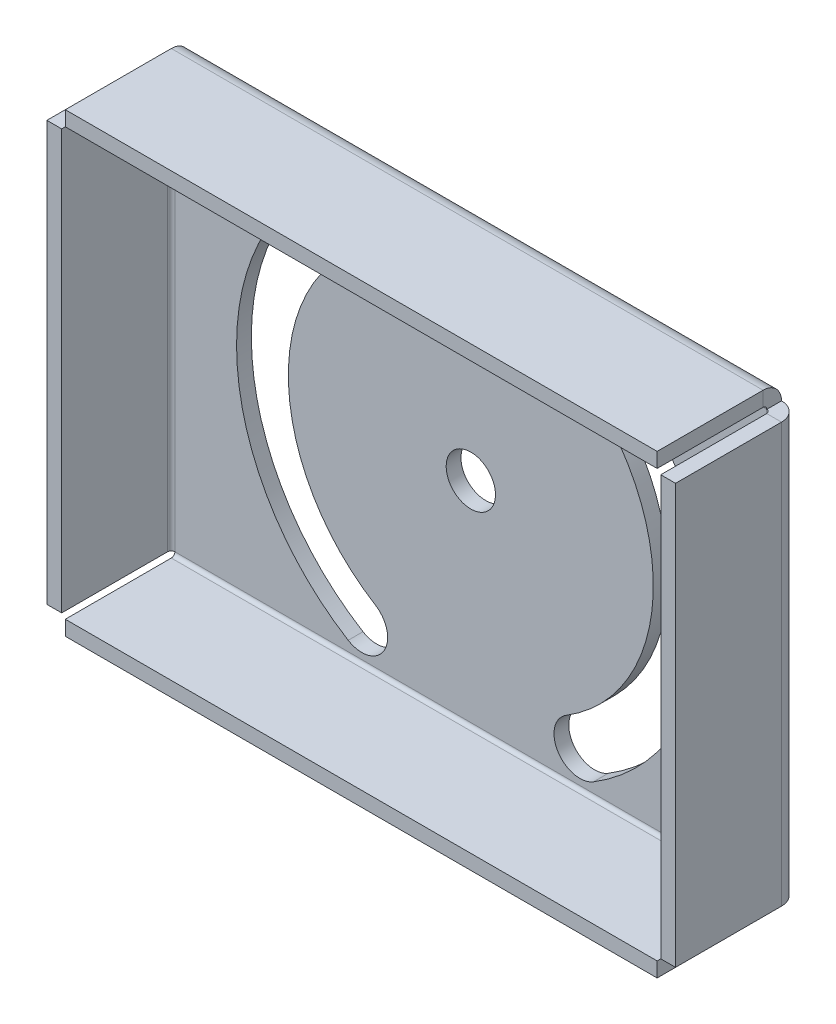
ISO-10303-21;
HEADER;
FILE_DESCRIPTION(('STEP AP214'),'2;1');
FILE_NAME('part.step','',(''),(''),'','','');
FILE_SCHEMA(('AUTOMOTIVE_DESIGN { 1 0 10303 214 1 1 1 1 }'));
ENDSEC;
DATA;
#1=APPLICATION_CONTEXT('core data for automotive mechanical design processes');
#2=APPLICATION_PROTOCOL_DEFINITION('international standard','automotive_design',2000,#1);
#3=PRODUCT_CONTEXT('',#1,'mechanical');
#4=PRODUCT('Part','Part','',(#3));
#5=PRODUCT_RELATED_PRODUCT_CATEGORY('part','',(#4));
#6=PRODUCT_DEFINITION_FORMATION('','',#4);
#7=PRODUCT_DEFINITION_CONTEXT('part definition',#1,'design');
#8=PRODUCT_DEFINITION('design','',#6,#7);
#9=PRODUCT_DEFINITION_SHAPE('','',#8);
#10=(LENGTH_UNIT() NAMED_UNIT(*) SI_UNIT(.MILLI.,.METRE.));
#11=(NAMED_UNIT(*) PLANE_ANGLE_UNIT() SI_UNIT($,.RADIAN.));
#12=(NAMED_UNIT(*) SI_UNIT($,.STERADIAN.) SOLID_ANGLE_UNIT());
#13=UNCERTAINTY_MEASURE_WITH_UNIT(LENGTH_MEASURE(1.E-05),#10,'distance_accuracy_value','');
#14=(GEOMETRIC_REPRESENTATION_CONTEXT(3) GLOBAL_UNCERTAINTY_ASSIGNED_CONTEXT((#13)) GLOBAL_UNIT_ASSIGNED_CONTEXT((#10,
#11,#12)) REPRESENTATION_CONTEXT('',''));
#15=CARTESIAN_POINT('',(0.,0.,0.));
#16=DIRECTION('',(0.,0.,1.));
#17=DIRECTION('',(1.,0.,0.));
#18=AXIS2_PLACEMENT_3D('',#15,#16,#17);
#19=CARTESIAN_POINT('',(-60.,67.5,0.));
#20=DIRECTION('',(0.,0.,-1.));
#21=DIRECTION('',(-1.00000000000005,0.,0.));
#22=AXIS2_PLACEMENT_3D('',#19,#20,#21);
#23=PLANE('',#22);
#24=CARTESIAN_POINT('',(0.,0.,0.));
#25=DIRECTION('',(0.,0.,1.));
#26=DIRECTION('',(-1.00000000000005,0.,0.));
#27=AXIS2_PLACEMENT_3D('',#24,#25,#26);
#28=CIRCLE('',#27,37.);
#29=CARTESIAN_POINT('',(-19.3667698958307,31.5266272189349,-8.2572837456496E-13));
#30=VERTEX_POINT('',#29);
#31=CARTESIAN_POINT('',(-19.3667698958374,-31.5266272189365,0.));
#32=VERTEX_POINT('',#31);
#33=EDGE_CURVE('E47',#30,#32,#28,.T.);
#34=ORIENTED_EDGE('',*,*,#33,.F.);
#35=CARTESIAN_POINT('',(-22.1147575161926,36.,0.));
#36=DIRECTION('',(0.,0.,-1.));
#37=DIRECTION('',(-1.00000000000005,0.,0.));
#38=AXIS2_PLACEMENT_3D('',#35,#36,#37);
#39=CIRCLE('',#38,5.24999999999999);
#40=CARTESIAN_POINT('',(-24.862745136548,40.4733727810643,0.));
#41=VERTEX_POINT('',#40);
#42=EDGE_CURVE('E235',#41,#30,#39,.T.);
#43=ORIENTED_EDGE('',*,*,#42,.F.);
#44=CARTESIAN_POINT('',(0.,0.,0.));
#45=DIRECTION('',(0.,0.,-1.));
#46=DIRECTION('',(-1.00000000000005,0.,0.));
#47=AXIS2_PLACEMENT_3D('',#44,#45,#46);
#48=CIRCLE('',#47,47.5);
#49=CARTESIAN_POINT('',(-24.862745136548,-40.4733727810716,-8.2572837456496E-13));
#50=VERTEX_POINT('',#49);
#51=EDGE_CURVE('E220',#50,#41,#48,.T.);
#52=ORIENTED_EDGE('',*,*,#51,.F.);
#53=CARTESIAN_POINT('',(-22.1147575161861,-36.0000000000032,0.));
#54=DIRECTION('',(0.,0.,-1.));
#55=DIRECTION('',(-1.00000000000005,0.,0.));
#56=AXIS2_PLACEMENT_3D('',#53,#54,#55);
#57=CIRCLE('',#56,5.24999999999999);
#58=EDGE_CURVE('E229',#32,#50,#57,.T.);
#59=ORIENTED_EDGE('',*,*,#58,.F.);
#60=EDGE_LOOP('',(#34,#43,#52,#59));
#61=FACE_BOUND('',#60,.T.);
#62=CARTESIAN_POINT('',(22.1147575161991,36.,-8.2572837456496E-13));
#63=DIRECTION('',(0.,0.,-1.));
#64=DIRECTION('',(-1.00000000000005,0.,0.));
#65=AXIS2_PLACEMENT_3D('',#62,#63,#64);
#66=CIRCLE('',#65,5.24999999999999);
#67=CARTESIAN_POINT('',(19.366769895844,31.5266272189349,0.));
#68=VERTEX_POINT('',#67);
#69=CARTESIAN_POINT('',(24.8627451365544,40.4733727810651,0.));
#70=VERTEX_POINT('',#69);
#71=EDGE_CURVE('E242',#68,#70,#66,.T.);
#72=ORIENTED_EDGE('',*,*,#71,.F.);
#73=CARTESIAN_POINT('',(0.,0.,0.));
#74=DIRECTION('',(0.,0.,1.));
#75=DIRECTION('',(-1.00000000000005,0.,0.));
#76=AXIS2_PLACEMENT_3D('',#73,#74,#75);
#77=CIRCLE('',#76,37.);
#78=CARTESIAN_POINT('',(19.3667698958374,-31.5266272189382,0.));
#79=VERTEX_POINT('',#78);
#80=EDGE_CURVE('E252',#79,#68,#77,.T.);
#81=ORIENTED_EDGE('',*,*,#80,.F.);
#82=CARTESIAN_POINT('',(22.1147575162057,-36.0000000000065,0.));
#83=DIRECTION('',(0.,0.,-1.));
#84=DIRECTION('',(-1.00000000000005,0.,0.));
#85=AXIS2_PLACEMENT_3D('',#82,#83,#84);
#86=CIRCLE('',#85,5.24999999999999);
#87=CARTESIAN_POINT('',(24.8627451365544,-40.4733727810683,0.));
#88=VERTEX_POINT('',#87);
#89=EDGE_CURVE('E249',#88,#79,#86,.T.);
#90=ORIENTED_EDGE('',*,*,#89,.F.);
#91=CARTESIAN_POINT('',(0.,0.,0.));
#92=DIRECTION('',(0.,0.,-1.));
#93=DIRECTION('',(-1.00000000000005,0.,0.));
#94=AXIS2_PLACEMENT_3D('',#91,#92,#93);
#95=CIRCLE('',#94,47.5);
#96=EDGE_CURVE('E246',#70,#88,#95,.T.);
#97=ORIENTED_EDGE('',*,*,#96,.F.);
#98=EDGE_LOOP('',(#72,#81,#90,#97));
#99=FACE_BOUND('',#98,.T.);
#100=CARTESIAN_POINT('',(0.,0.,0.));
#101=DIRECTION('',(0.,0.,-1.));
#102=DIRECTION('',(-1.00000000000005,0.,0.));
#103=AXIS2_PLACEMENT_3D('',#100,#101,#102);
#104=CIRCLE('',#103,4.99999999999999);
#105=CARTESIAN_POINT('',(-5.00000000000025,0.,0.));
#106=VERTEX_POINT('',#105);
#107=EDGE_CURVE('E258',#106,#106,#104,.T.);
#108=ORIENTED_EDGE('',*,*,#107,.F.);
#109=EDGE_LOOP('',(#108));
#110=FACE_BOUND('',#109,.T.);
#111=DIRECTION('',(0.,-1.00000000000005,0.));
#112=VECTOR('',#111,1.);
#113=CARTESIAN_POINT('',(60.0000000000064,67.5000000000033,-8.2572837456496E-13));
#114=LINE('',#113,#112);
#115=CARTESIAN_POINT('',(60.0000000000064,42.5,-4.462470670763E-08));
#116=VERTEX_POINT('',#115);
#117=CARTESIAN_POINT('',(60.0000000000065,-42.5000000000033,-6.29995847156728E-08));
#118=VERTEX_POINT('',#117);
#119=EDGE_CURVE('E441',#116,#118,#114,.T.);
#120=ORIENTED_EDGE('',*,*,#119,.T.);
#121=DIRECTION('',(-1.00000000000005,0.,0.));
#122=VECTOR('',#121,1.);
#123=CARTESIAN_POINT('',(-60.,-42.5000000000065,0.));
#124=LINE('',#123,#122);
#125=CARTESIAN_POINT('',(-60.,-42.5000000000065,-4.462470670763E-08));
#126=VERTEX_POINT('',#125);
#127=EDGE_CURVE('E459',#118,#126,#124,.T.);
#128=ORIENTED_EDGE('',*,*,#127,.T.);
#129=DIRECTION('',(0.,-1.00000000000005,0.));
#130=VECTOR('',#129,1.);
#131=CARTESIAN_POINT('',(-60.,67.5,0.));
#132=LINE('',#131,#130);
#133=CARTESIAN_POINT('',(-60.,42.5,-6.29995847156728E-08));
#134=VERTEX_POINT('',#133);
#135=EDGE_CURVE('E452',#134,#126,#132,.T.);
#136=ORIENTED_EDGE('',*,*,#135,.F.);
#137=DIRECTION('',(1.00000000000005,0.,0.));
#138=VECTOR('',#137,1.);
#139=CARTESIAN_POINT('',(-60.,42.5,0.));
#140=LINE('',#139,#138);
#141=EDGE_CURVE('E433',#134,#116,#140,.T.);
#142=ORIENTED_EDGE('',*,*,#141,.T.);
#143=EDGE_LOOP('',(#120,#128,#136,#142));
#144=FACE_BOUND('',#143,.T.);
#145=ADVANCED_FACE('F33',(#61,#99,#110,#144),#23,.T.);
#146=CARTESIAN_POINT('',(-60.,67.5,3.));
#147=DIRECTION('',(0.,0.,-1.));
#148=DIRECTION('',(-1.00000000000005,0.,0.));
#149=AXIS2_PLACEMENT_3D('',#146,#147,#148);
#150=PLANE('',#149);
#151=CARTESIAN_POINT('',(-22.1147575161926,36.,3.));
#152=DIRECTION('',(0.,0.,-1.));
#153=DIRECTION('',(-1.00000000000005,0.,0.));
#154=AXIS2_PLACEMENT_3D('',#151,#152,#153);
#155=CIRCLE('',#154,5.24999999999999);
#156=CARTESIAN_POINT('',(-24.862745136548,40.4733727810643,3.));
#157=VERTEX_POINT('',#156);
#158=CARTESIAN_POINT('',(-19.3667698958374,31.5266272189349,2.99999999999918));
#159=VERTEX_POINT('',#158);
#160=EDGE_CURVE('E40',#157,#159,#155,.T.);
#161=ORIENTED_EDGE('',*,*,#160,.T.);
#162=CARTESIAN_POINT('',(0.,0.,3.));
#163=DIRECTION('',(0.,0.,-1.));
#164=DIRECTION('',(-1.00000000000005,0.,0.));
#165=AXIS2_PLACEMENT_3D('',#162,#163,#164);
#166=CIRCLE('',#165,37.);
#167=CARTESIAN_POINT('',(-19.3667698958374,-31.5266272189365,3.));
#168=VERTEX_POINT('',#167);
#169=EDGE_CURVE('E11',#159,#168,#166,.F.);
#170=ORIENTED_EDGE('',*,*,#169,.T.);
#171=CARTESIAN_POINT('',(-22.1147575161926,-36.0000000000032,3.));
#172=DIRECTION('',(0.,0.,-1.));
#173=DIRECTION('',(-1.00000000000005,0.,0.));
#174=AXIS2_PLACEMENT_3D('',#171,#172,#173);
#175=CIRCLE('',#174,5.24999999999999);
#176=CARTESIAN_POINT('',(-24.862745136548,-40.4733727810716,2.99999999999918));
#177=VERTEX_POINT('',#176);
#178=EDGE_CURVE('E479',#168,#177,#175,.T.);
#179=ORIENTED_EDGE('',*,*,#178,.T.);
#180=CARTESIAN_POINT('',(0.,0.,3.));
#181=DIRECTION('',(0.,0.,-1.));
#182=DIRECTION('',(-1.00000000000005,0.,0.));
#183=AXIS2_PLACEMENT_3D('',#180,#181,#182);
#184=CIRCLE('',#183,47.5);
#185=EDGE_CURVE('E223',#177,#157,#184,.T.);
#186=ORIENTED_EDGE('',*,*,#185,.T.);
#187=EDGE_LOOP('',(#161,#170,#179,#186));
#188=FACE_BOUND('',#187,.T.);
#189=CARTESIAN_POINT('',(0.,0.,3.));
#190=DIRECTION('',(0.,0.,-1.));
#191=DIRECTION('',(-1.00000000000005,0.,0.));
#192=AXIS2_PLACEMENT_3D('',#189,#190,#191);
#193=CIRCLE('',#192,37.);
#194=CARTESIAN_POINT('',(19.3667698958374,-31.5266272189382,3.));
#195=VERTEX_POINT('',#194);
#196=CARTESIAN_POINT('',(19.3667698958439,31.5266272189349,3.));
#197=VERTEX_POINT('',#196);
#198=EDGE_CURVE('E473',#195,#197,#193,.F.);
#199=ORIENTED_EDGE('',*,*,#198,.T.);
#200=CARTESIAN_POINT('',(22.1147575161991,36.,2.99999999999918));
#201=DIRECTION('',(0.,0.,-1.));
#202=DIRECTION('',(-1.00000000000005,0.,0.));
#203=AXIS2_PLACEMENT_3D('',#200,#201,#202);
#204=CIRCLE('',#203,5.24999999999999);
#205=CARTESIAN_POINT('',(24.8627451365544,40.4733727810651,3.));
#206=VERTEX_POINT('',#205);
#207=EDGE_CURVE('E476',#197,#206,#204,.T.);
#208=ORIENTED_EDGE('',*,*,#207,.T.);
#209=CARTESIAN_POINT('',(0.,0.,3.));
#210=DIRECTION('',(0.,0.,-1.));
#211=DIRECTION('',(-1.00000000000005,0.,0.));
#212=AXIS2_PLACEMENT_3D('',#209,#210,#211);
#213=CIRCLE('',#212,47.5);
#214=CARTESIAN_POINT('',(24.8627451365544,-40.4733727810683,3.));
#215=VERTEX_POINT('',#214);
#216=EDGE_CURVE('E465',#206,#215,#213,.T.);
#217=ORIENTED_EDGE('',*,*,#216,.T.);
#218=CARTESIAN_POINT('',(22.1147575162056,-36.0000000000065,3.));
#219=DIRECTION('',(0.,0.,-1.));
#220=DIRECTION('',(-1.00000000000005,0.,0.));
#221=AXIS2_PLACEMENT_3D('',#218,#219,#220);
#222=CIRCLE('',#221,5.24999999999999);
#223=EDGE_CURVE('E470',#215,#195,#222,.T.);
#224=ORIENTED_EDGE('',*,*,#223,.T.);
#225=EDGE_LOOP('',(#199,#208,#217,#224));
#226=FACE_BOUND('',#225,.T.);
#227=CARTESIAN_POINT('',(0.,0.,3.));
#228=DIRECTION('',(0.,0.,-1.));
#229=DIRECTION('',(-1.00000000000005,0.,0.));
#230=AXIS2_PLACEMENT_3D('',#227,#228,#229);
#231=CIRCLE('',#230,4.99999999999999);
#232=CARTESIAN_POINT('',(-5.00000000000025,0.,3.));
#233=VERTEX_POINT('',#232);
#234=EDGE_CURVE('E267',#233,#233,#231,.T.);
#235=ORIENTED_EDGE('',*,*,#234,.T.);
#236=EDGE_LOOP('',(#235));
#237=FACE_BOUND('',#236,.T.);
#238=DIRECTION('',(-1.00000000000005,0.,0.));
#239=VECTOR('',#238,1.);
#240=CARTESIAN_POINT('',(-60.,-42.5000000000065,3.));
#241=LINE('',#240,#239);
#242=CARTESIAN_POINT('',(60.0000000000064,-42.5000000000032,3.00000002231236));
#243=VERTEX_POINT('',#242);
#244=CARTESIAN_POINT('',(-60.,-42.5000000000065,3.));
#245=VERTEX_POINT('',#244);
#246=EDGE_CURVE('E455',#243,#245,#241,.T.);
#247=ORIENTED_EDGE('',*,*,#246,.F.);
#248=DIRECTION('',(0.,-1.00000000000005,0.));
#249=VECTOR('',#248,1.);
#250=CARTESIAN_POINT('',(60.0000000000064,67.5000000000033,2.99999999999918));
#251=LINE('',#250,#249);
#252=CARTESIAN_POINT('',(60.0000000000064,42.5,3.00000003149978));
#253=VERTEX_POINT('',#252);
#254=EDGE_CURVE('E436',#253,#243,#251,.T.);
#255=ORIENTED_EDGE('',*,*,#254,.F.);
#256=DIRECTION('',(1.00000000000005,0.,0.));
#257=VECTOR('',#256,1.);
#258=CARTESIAN_POINT('',(-60.,42.5,3.));
#259=LINE('',#258,#257);
#260=CARTESIAN_POINT('',(-60.,42.5,3.00000003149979));
#261=VERTEX_POINT('',#260);
#262=EDGE_CURVE('E432',#261,#253,#259,.T.);
#263=ORIENTED_EDGE('',*,*,#262,.F.);
#264=DIRECTION('',(0.,-1.00000000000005,0.));
#265=VECTOR('',#264,1.);
#266=CARTESIAN_POINT('',(-60.,67.5,3.));
#267=LINE('',#266,#265);
#268=EDGE_CURVE('E447',#261,#245,#267,.T.);
#269=ORIENTED_EDGE('',*,*,#268,.T.);
#270=EDGE_LOOP('',(#247,#255,#263,#269));
#271=FACE_BOUND('',#270,.T.);
#272=ADVANCED_FACE('F483',(#188,#226,#237,#271),#150,.F.);
#273=CARTESIAN_POINT('',(-60.0000000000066,42.5,3.73660004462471));
#274=DIRECTION('',(1.00000000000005,0.,0.));
#275=DIRECTION('',(0.,0.,-1.));
#276=AXIS2_PLACEMENT_3D('',#273,#274,#275);
#277=PLANE('',#276);
#278=DIRECTION('',(0.,-1.00000000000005,0.));
#279=VECTOR('',#278,1.);
#280=CARTESIAN_POINT('',(-60.0000000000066,43.2366,3.73659999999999));
#281=LINE('',#280,#279);
#282=CARTESIAN_POINT('',(-60.,46.2366000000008,3.73660000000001));
#283=VERTEX_POINT('',#282);
#284=CARTESIAN_POINT('',(-60.0000000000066,43.2366,3.73660000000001));
#285=VERTEX_POINT('',#284);
#286=EDGE_CURVE('E407',#283,#285,#281,.T.);
#287=ORIENTED_EDGE('',*,*,#286,.F.);
#288=CARTESIAN_POINT('',(-60.0000000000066,42.5,3.7366));
#289=DIRECTION('',(-1.00000000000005,0.,0.));
#290=DIRECTION('',(0.,-1.00000000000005,0.));
#291=AXIS2_PLACEMENT_3D('',#288,#289,#290);
#292=CIRCLE('',#291,3.73660004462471);
#293=EDGE_CURVE('E415',#283,#134,#292,.T.);
#294=ORIENTED_EDGE('',*,*,#293,.T.);
#295=DIRECTION('',(0.,0.,-1.));
#296=VECTOR('',#295,1.);
#297=CARTESIAN_POINT('',(-60.,42.5,3.));
#298=LINE('',#297,#296);
#299=EDGE_CURVE('E450',#261,#134,#298,.T.);
#300=ORIENTED_EDGE('',*,*,#299,.F.);
#301=CARTESIAN_POINT('',(-60.0000000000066,42.5,3.73660004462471));
#302=DIRECTION('',(-1.00000000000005,0.,0.));
#303=DIRECTION('',(0.,0.,1.));
#304=AXIS2_PLACEMENT_3D('',#301,#302,#303);
#305=CIRCLE('',#304,0.736600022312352);
#306=EDGE_CURVE('E426',#285,#261,#305,.T.);
#307=ORIENTED_EDGE('',*,*,#306,.F.);
#308=EDGE_LOOP('',(#287,#294,#300,#307));
#309=FACE_BOUND('',#308,.T.);
#310=ADVANCED_FACE('F506',(#309),#277,.F.);
#311=CARTESIAN_POINT('',(60.0000000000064,42.5,3.73660004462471));
#312=DIRECTION('',(-1.00000000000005,0.,0.));
#313=DIRECTION('',(0.,0.,1.));
#314=AXIS2_PLACEMENT_3D('',#311,#312,#313);
#315=PLANE('',#314);
#316=CARTESIAN_POINT('',(60.0000000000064,42.5,3.7366));
#317=DIRECTION('',(-1.00000000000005,0.,0.));
#318=DIRECTION('',(0.,-1.00000000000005,0.));
#319=AXIS2_PLACEMENT_3D('',#316,#317,#318);
#320=CIRCLE('',#319,3.73660004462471);
#321=CARTESIAN_POINT('',(60.000000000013,46.2366000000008,3.73660000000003));
#322=VERTEX_POINT('',#321);
#323=EDGE_CURVE('E423',#116,#322,#320,.F.);
#324=ORIENTED_EDGE('',*,*,#323,.T.);
#325=DIRECTION('',(0.,1.00000000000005,0.));
#326=VECTOR('',#325,1.);
#327=CARTESIAN_POINT('',(60.0000000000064,43.2366000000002,3.73659999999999));
#328=LINE('',#327,#326);
#329=CARTESIAN_POINT('',(60.0000000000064,43.2366,3.7366));
#330=VERTEX_POINT('',#329);
#331=EDGE_CURVE('E412',#330,#322,#328,.T.);
#332=ORIENTED_EDGE('',*,*,#331,.F.);
#333=CARTESIAN_POINT('',(60.0000000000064,42.5,3.73660004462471));
#334=DIRECTION('',(1.00000000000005,0.,0.));
#335=DIRECTION('',(0.,0.,-1.));
#336=AXIS2_PLACEMENT_3D('',#333,#334,#335);
#337=CIRCLE('',#336,0.736600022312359);
#338=EDGE_CURVE('E429',#253,#330,#337,.T.);
#339=ORIENTED_EDGE('',*,*,#338,.F.);
#340=DIRECTION('',(0.,0.,-1.));
#341=VECTOR('',#340,1.);
#342=CARTESIAN_POINT('',(60.0000000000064,42.5,3.));
#343=LINE('',#342,#341);
#344=EDGE_CURVE('E444',#253,#116,#343,.T.);
#345=ORIENTED_EDGE('',*,*,#344,.T.);
#346=EDGE_LOOP('',(#324,#332,#339,#345));
#347=FACE_BOUND('',#346,.T.);
#348=ADVANCED_FACE('F510',(#347),#315,.F.);
#349=CARTESIAN_POINT('',(120.08889572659,42.5,3.7366));
#350=DIRECTION('',(-1.00000000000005,0.,0.));
#351=DIRECTION('',(0.,-1.00000000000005,0.));
#352=AXIS2_PLACEMENT_3D('',#349,#350,#351);
#353=CYLINDRICAL_SURFACE('',#352,0.736600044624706);
#354=ORIENTED_EDGE('',*,*,#262,.T.);
#355=ORIENTED_EDGE('',*,*,#338,.T.);
#356=DIRECTION('',(1.00000000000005,0.,0.));
#357=VECTOR('',#356,1.);
#358=CARTESIAN_POINT('',(-60.0000000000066,43.2366,3.73659999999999));
#359=LINE('',#358,#357);
#360=EDGE_CURVE('E405',#285,#330,#359,.T.);
#361=ORIENTED_EDGE('',*,*,#360,.F.);
#362=ORIENTED_EDGE('',*,*,#306,.T.);
#363=EDGE_LOOP('',(#354,#355,#361,#362));
#364=FACE_BOUND('',#363,.T.);
#365=ADVANCED_FACE('F513',(#364),#353,.F.);
#366=CARTESIAN_POINT('',(120.08889572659,42.5,3.7366));
#367=DIRECTION('',(-1.00000000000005,0.,0.));
#368=DIRECTION('',(0.,-1.00000000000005,0.));
#369=AXIS2_PLACEMENT_3D('',#366,#367,#368);
#370=CYLINDRICAL_SURFACE('',#369,3.73660004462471);
#371=ORIENTED_EDGE('',*,*,#141,.F.);
#372=ORIENTED_EDGE('',*,*,#293,.F.);
#373=DIRECTION('',(1.00000000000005,0.,0.));
#374=VECTOR('',#373,1.);
#375=CARTESIAN_POINT('',(-60.,46.2366000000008,3.73660000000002));
#376=LINE('',#375,#374);
#377=EDGE_CURVE('E409',#283,#322,#376,.T.);
#378=ORIENTED_EDGE('',*,*,#377,.T.);
#379=ORIENTED_EDGE('',*,*,#323,.F.);
#380=EDGE_LOOP('',(#371,#372,#378,#379));
#381=FACE_BOUND('',#380,.T.);
#382=ADVANCED_FACE('F517',(#381),#370,.T.);
#383=CARTESIAN_POINT('',(60.0000000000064,43.2365999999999,25.2233569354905));
#384=DIRECTION('',(-1.00000000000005,0.,0.));
#385=DIRECTION('',(0.,0.,-1.));
#386=AXIS2_PLACEMENT_3D('',#383,#384,#385);
#387=PLANE('',#386);
#388=DIRECTION('',(0.,0.,1.));
#389=VECTOR('',#388,1.);
#390=CARTESIAN_POINT('',(60.0000000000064,43.2365999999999,25.2233569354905));
#391=LINE('',#390,#389);
#392=CARTESIAN_POINT('',(60.0000000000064,43.2365999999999,25.2233569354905));
#393=VERTEX_POINT('',#392);
#394=EDGE_CURVE('E399',#330,#393,#391,.T.);
#395=ORIENTED_EDGE('',*,*,#394,.F.);
#396=ORIENTED_EDGE('',*,*,#331,.T.);
#397=DIRECTION('',(0.,0.,1.));
#398=VECTOR('',#397,1.);
#399=CARTESIAN_POINT('',(60.0000000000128,46.2366000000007,25.2233569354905));
#400=LINE('',#399,#398);
#401=CARTESIAN_POINT('',(60.0000000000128,46.2366000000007,25.2233569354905));
#402=VERTEX_POINT('',#401);
#403=EDGE_CURVE('E395',#322,#402,#400,.T.);
#404=ORIENTED_EDGE('',*,*,#403,.T.);
#405=DIRECTION('',(0.,1.00000000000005,0.));
#406=VECTOR('',#405,1.);
#407=CARTESIAN_POINT('',(60.0000000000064,43.2365999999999,25.2233569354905));
#408=LINE('',#407,#406);
#409=EDGE_CURVE('E402',#393,#402,#408,.T.);
#410=ORIENTED_EDGE('',*,*,#409,.F.);
#411=EDGE_LOOP('',(#395,#396,#404,#410));
#412=FACE_BOUND('',#411,.T.);
#413=ADVANCED_FACE('F524',(#412),#387,.F.);
#414=CARTESIAN_POINT('',(-60.,43.2366,0.223356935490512));
#415=DIRECTION('',(1.00000000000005,0.,0.));
#416=DIRECTION('',(0.,1.00000000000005,0.));
#417=AXIS2_PLACEMENT_3D('',#414,#415,#416);
#418=PLANE('',#417);
#419=DIRECTION('',(0.,0.,-1.));
#420=VECTOR('',#419,1.);
#421=CARTESIAN_POINT('',(-60.,46.2366000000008,0.223356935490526));
#422=LINE('',#421,#420);
#423=CARTESIAN_POINT('',(-60.,46.2366000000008,25.2233569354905));
#424=VERTEX_POINT('',#423);
#425=EDGE_CURVE('E391',#424,#283,#422,.T.);
#426=ORIENTED_EDGE('',*,*,#425,.T.);
#427=ORIENTED_EDGE('',*,*,#286,.T.);
#428=DIRECTION('',(0.,0.,-1.));
#429=VECTOR('',#428,1.);
#430=CARTESIAN_POINT('',(-60.,43.2366,0.223356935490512));
#431=LINE('',#430,#429);
#432=CARTESIAN_POINT('',(-60.0000000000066,43.2366,25.2233569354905));
#433=VERTEX_POINT('',#432);
#434=EDGE_CURVE('E394',#433,#285,#431,.T.);
#435=ORIENTED_EDGE('',*,*,#434,.F.);
#436=DIRECTION('',(0.,1.00000000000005,0.));
#437=VECTOR('',#436,1.);
#438=CARTESIAN_POINT('',(-60.0000000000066,43.2366,25.2233569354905));
#439=LINE('',#438,#437);
#440=EDGE_CURVE('E398',#433,#424,#439,.T.);
#441=ORIENTED_EDGE('',*,*,#440,.T.);
#442=EDGE_LOOP('',(#426,#427,#435,#441));
#443=FACE_BOUND('',#442,.T.);
#444=ADVANCED_FACE('F528',(#443),#418,.F.);
#445=CARTESIAN_POINT('',(-60.0000000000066,43.2366,25.2233569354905));
#446=DIRECTION('',(0.,1.00000000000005,0.));
#447=DIRECTION('',(-1.00000000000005,0.,0.));
#448=AXIS2_PLACEMENT_3D('',#445,#446,#447);
#449=PLANE('',#448);
#450=ORIENTED_EDGE('',*,*,#434,.T.);
#451=ORIENTED_EDGE('',*,*,#360,.T.);
#452=ORIENTED_EDGE('',*,*,#394,.T.);
#453=DIRECTION('',(-1.00000000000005,0.,0.));
#454=VECTOR('',#453,1.);
#455=CARTESIAN_POINT('',(-60.0000000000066,43.2366,25.2233569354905));
#456=LINE('',#455,#454);
#457=EDGE_CURVE('E396',#393,#433,#456,.T.);
#458=ORIENTED_EDGE('',*,*,#457,.T.);
#459=EDGE_LOOP('',(#450,#451,#452,#458));
#460=FACE_BOUND('',#459,.T.);
#461=ADVANCED_FACE('F538',(#460),#449,.F.);
#462=CARTESIAN_POINT('',(-60.0000000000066,43.2366,25.2233569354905));
#463=DIRECTION('',(0.,0.,-1.));
#464=DIRECTION('',(0.,1.00000000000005,0.));
#465=AXIS2_PLACEMENT_3D('',#462,#463,#464);
#466=PLANE('',#465);
#467=DIRECTION('',(-1.00000000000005,0.,0.));
#468=VECTOR('',#467,1.);
#469=CARTESIAN_POINT('',(-60.,46.2366000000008,25.2233569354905));
#470=LINE('',#469,#468);
#471=EDGE_CURVE('E392',#402,#424,#470,.T.);
#472=ORIENTED_EDGE('',*,*,#471,.T.);
#473=ORIENTED_EDGE('',*,*,#440,.F.);
#474=ORIENTED_EDGE('',*,*,#457,.F.);
#475=ORIENTED_EDGE('',*,*,#409,.T.);
#476=EDGE_LOOP('',(#472,#473,#474,#475));
#477=FACE_BOUND('',#476,.T.);
#478=ADVANCED_FACE('F534',(#477),#466,.F.);
#479=CARTESIAN_POINT('',(-60.,46.2366000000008,25.2233569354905));
#480=DIRECTION('',(0.,1.00000000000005,0.));
#481=DIRECTION('',(-1.00000000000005,0.,0.));
#482=AXIS2_PLACEMENT_3D('',#479,#480,#481);
#483=PLANE('',#482);
#484=ORIENTED_EDGE('',*,*,#377,.F.);
#485=ORIENTED_EDGE('',*,*,#425,.F.);
#486=ORIENTED_EDGE('',*,*,#471,.F.);
#487=ORIENTED_EDGE('',*,*,#403,.F.);
#488=EDGE_LOOP('',(#484,#485,#486,#487));
#489=FACE_BOUND('',#488,.T.);
#490=ADVANCED_FACE('F530',(#489),#483,.T.);
#491=CARTESIAN_POINT('',(60.0000000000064,42.5,3.73660006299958));
#492=DIRECTION('',(0.,-1.00000000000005,0.));
#493=DIRECTION('',(0.,0.,-1.));
#494=AXIS2_PLACEMENT_3D('',#491,#492,#493);
#495=PLANE('',#494);
#496=DIRECTION('',(-1.00000000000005,0.,0.));
#497=VECTOR('',#496,1.);
#498=CARTESIAN_POINT('',(60.7366000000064,42.4999999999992,3.7366));
#499=LINE('',#498,#497);
#500=CARTESIAN_POINT('',(63.7366000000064,42.5,3.73659999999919));
#501=VERTEX_POINT('',#500);
#502=CARTESIAN_POINT('',(60.7366000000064,42.4999999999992,3.73660000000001));
#503=VERTEX_POINT('',#502);
#504=EDGE_CURVE('E356',#501,#503,#499,.T.);
#505=ORIENTED_EDGE('',*,*,#504,.F.);
#506=CARTESIAN_POINT('',(60.0000000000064,42.4999999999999,3.7366));
#507=DIRECTION('',(0.,1.00000000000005,0.));
#508=DIRECTION('',(-1.00000000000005,0.,0.));
#509=AXIS2_PLACEMENT_3D('',#506,#507,#508);
#510=CIRCLE('',#509,3.73660006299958);
#511=EDGE_CURVE('E355',#501,#116,#510,.T.);
#512=ORIENTED_EDGE('',*,*,#511,.T.);
#513=ORIENTED_EDGE('',*,*,#344,.F.);
#514=CARTESIAN_POINT('',(60.0000000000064,42.5,3.73660006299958));
#515=DIRECTION('',(0.,1.00000000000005,0.));
#516=DIRECTION('',(0.,0.,1.));
#517=AXIS2_PLACEMENT_3D('',#514,#515,#516);
#518=CIRCLE('',#517,0.736600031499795);
#519=EDGE_CURVE('E385',#503,#253,#518,.T.);
#520=ORIENTED_EDGE('',*,*,#519,.F.);
#521=EDGE_LOOP('',(#505,#512,#513,#520));
#522=FACE_BOUND('',#521,.T.);
#523=ADVANCED_FACE('F533',(#522),#495,.F.);
#524=CARTESIAN_POINT('',(60.0000000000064,-42.5000000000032,3.73660006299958));
#525=DIRECTION('',(0.,1.00000000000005,0.));
#526=DIRECTION('',(0.,0.,1.));
#527=AXIS2_PLACEMENT_3D('',#524,#525,#526);
#528=PLANE('',#527);
#529=CARTESIAN_POINT('',(60.0000000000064,-42.5000000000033,3.7366));
#530=DIRECTION('',(0.,1.00000000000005,0.));
#531=DIRECTION('',(-1.00000000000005,0.,0.));
#532=AXIS2_PLACEMENT_3D('',#529,#530,#531);
#533=CIRCLE('',#532,3.73660006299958);
#534=CARTESIAN_POINT('',(63.7366000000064,-42.5000000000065,3.7366));
#535=VERTEX_POINT('',#534);
#536=EDGE_CURVE('E382',#118,#535,#533,.F.);
#537=ORIENTED_EDGE('',*,*,#536,.T.);
#538=DIRECTION('',(1.00000000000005,0.,0.));
#539=VECTOR('',#538,1.);
#540=CARTESIAN_POINT('',(60.7366000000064,-42.5000000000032,3.7366));
#541=LINE('',#540,#539);
#542=CARTESIAN_POINT('',(60.7366000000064,-42.5000000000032,3.7366));
#543=VERTEX_POINT('',#542);
#544=EDGE_CURVE('E362',#543,#535,#541,.T.);
#545=ORIENTED_EDGE('',*,*,#544,.F.);
#546=CARTESIAN_POINT('',(60.0000000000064,-42.5000000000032,3.73660006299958));
#547=DIRECTION('',(0.,-1.00000000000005,0.));
#548=DIRECTION('',(0.,0.,-1.));
#549=AXIS2_PLACEMENT_3D('',#546,#547,#548);
#550=CIRCLE('',#549,0.736600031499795);
#551=EDGE_CURVE('E388',#243,#543,#550,.T.);
#552=ORIENTED_EDGE('',*,*,#551,.F.);
#553=DIRECTION('',(0.,0.,-1.));
#554=VECTOR('',#553,1.);
#555=CARTESIAN_POINT('',(60.0000000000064,-42.5000000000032,3.));
#556=LINE('',#555,#554);
#557=EDGE_CURVE('E462',#243,#118,#556,.T.);
#558=ORIENTED_EDGE('',*,*,#557,.T.);
#559=EDGE_LOOP('',(#537,#545,#552,#558));
#560=FACE_BOUND('',#559,.T.);
#561=ADVANCED_FACE('F546',(#560),#528,.F.);
#562=CARTESIAN_POINT('',(60.0000000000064,-85.1254537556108,3.7366));
#563=DIRECTION('',(0.,1.00000000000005,0.));
#564=DIRECTION('',(-1.00000000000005,0.,0.));
#565=AXIS2_PLACEMENT_3D('',#562,#563,#564);
#566=CYLINDRICAL_SURFACE('',#565,0.736600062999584);
#567=ORIENTED_EDGE('',*,*,#254,.T.);
#568=ORIENTED_EDGE('',*,*,#551,.T.);
#569=DIRECTION('',(0.,-1.00000000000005,0.));
#570=VECTOR('',#569,1.);
#571=CARTESIAN_POINT('',(60.7366000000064,67.5000000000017,3.73659999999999));
#572=LINE('',#571,#570);
#573=EDGE_CURVE('E369',#503,#543,#572,.T.);
#574=ORIENTED_EDGE('',*,*,#573,.F.);
#575=ORIENTED_EDGE('',*,*,#519,.T.);
#576=EDGE_LOOP('',(#567,#568,#574,#575));
#577=FACE_BOUND('',#576,.T.);
#578=ADVANCED_FACE('F549',(#577),#566,.F.);
#579=CARTESIAN_POINT('',(60.0000000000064,-85.1254537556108,3.7366));
#580=DIRECTION('',(0.,1.00000000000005,0.));
#581=DIRECTION('',(-1.00000000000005,0.,0.));
#582=AXIS2_PLACEMENT_3D('',#579,#580,#581);
#583=CYLINDRICAL_SURFACE('',#582,3.73660006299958);
#584=ORIENTED_EDGE('',*,*,#119,.F.);
#585=ORIENTED_EDGE('',*,*,#511,.F.);
#586=DIRECTION('',(0.,-1.00000000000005,0.));
#587=VECTOR('',#586,1.);
#588=CARTESIAN_POINT('',(63.7366000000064,67.5000000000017,3.7366));
#589=LINE('',#588,#587);
#590=EDGE_CURVE('E351',#501,#535,#589,.T.);
#591=ORIENTED_EDGE('',*,*,#590,.T.);
#592=ORIENTED_EDGE('',*,*,#536,.F.);
#593=EDGE_LOOP('',(#584,#585,#591,#592));
#594=FACE_BOUND('',#593,.T.);
#595=ADVANCED_FACE('F551',(#594),#583,.T.);
#596=CARTESIAN_POINT('',(60.7366000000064,42.4999999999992,25.2233569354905));
#597=DIRECTION('',(0.,0.,-1.));
#598=DIRECTION('',(-1.00000000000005,0.,0.));
#599=AXIS2_PLACEMENT_3D('',#596,#597,#598);
#600=PLANE('',#599);
#601=DIRECTION('',(0.,1.00000000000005,0.));
#602=VECTOR('',#601,1.);
#603=CARTESIAN_POINT('',(63.7366000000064,42.5,25.2233569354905));
#604=LINE('',#603,#602);
#605=CARTESIAN_POINT('',(63.7366000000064,-42.5000000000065,25.2233569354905));
#606=VERTEX_POINT('',#605);
#607=CARTESIAN_POINT('',(63.7366000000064,42.5,25.2233569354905));
#608=VERTEX_POINT('',#607);
#609=EDGE_CURVE('E377',#606,#608,#604,.T.);
#610=ORIENTED_EDGE('',*,*,#609,.T.);
#611=DIRECTION('',(1.00000000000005,0.,0.));
#612=VECTOR('',#611,1.);
#613=CARTESIAN_POINT('',(60.7366000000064,42.4999999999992,25.2233569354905));
#614=LINE('',#613,#612);
#615=CARTESIAN_POINT('',(60.7366000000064,42.4999999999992,25.2233569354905));
#616=VERTEX_POINT('',#615);
#617=EDGE_CURVE('E352',#616,#608,#614,.T.);
#618=ORIENTED_EDGE('',*,*,#617,.F.);
#619=DIRECTION('',(0.,1.00000000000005,0.));
#620=VECTOR('',#619,1.);
#621=CARTESIAN_POINT('',(60.7366000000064,42.4999999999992,25.2233569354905));
#622=LINE('',#621,#620);
#623=CARTESIAN_POINT('',(60.7366000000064,-42.5000000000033,25.2233569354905));
#624=VERTEX_POINT('',#623);
#625=EDGE_CURVE('E365',#624,#616,#622,.T.);
#626=ORIENTED_EDGE('',*,*,#625,.F.);
#627=DIRECTION('',(1.00000000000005,0.,0.));
#628=VECTOR('',#627,1.);
#629=CARTESIAN_POINT('',(60.7366000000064,-42.5000000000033,25.2233569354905));
#630=LINE('',#629,#628);
#631=EDGE_CURVE('E374',#624,#606,#630,.T.);
#632=ORIENTED_EDGE('',*,*,#631,.T.);
#633=EDGE_LOOP('',(#610,#618,#626,#632));
#634=FACE_BOUND('',#633,.T.);
#635=ADVANCED_FACE('F560',(#634),#600,.F.);
#636=CARTESIAN_POINT('',(60.7366000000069,67.5000000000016,-119.776643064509));
#637=DIRECTION('',(1.00000000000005,0.,0.));
#638=DIRECTION('',(0.,0.,-1.));
#639=AXIS2_PLACEMENT_3D('',#636,#637,#638);
#640=PLANE('',#639);
#641=DIRECTION('',(0.,0.,-1.));
#642=VECTOR('',#641,1.);
#643=CARTESIAN_POINT('',(60.7366000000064,42.4999999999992,0.223356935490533));
#644=LINE('',#643,#642);
#645=EDGE_CURVE('E371',#616,#503,#644,.T.);
#646=ORIENTED_EDGE('',*,*,#645,.T.);
#647=ORIENTED_EDGE('',*,*,#573,.T.);
#648=DIRECTION('',(0.,0.,1.));
#649=VECTOR('',#648,1.);
#650=CARTESIAN_POINT('',(60.7366000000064,-42.5000000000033,25.2233569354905));
#651=LINE('',#650,#649);
#652=EDGE_CURVE('E367',#543,#624,#651,.T.);
#653=ORIENTED_EDGE('',*,*,#652,.T.);
#654=ORIENTED_EDGE('',*,*,#625,.T.);
#655=EDGE_LOOP('',(#646,#647,#653,#654));
#656=FACE_BOUND('',#655,.T.);
#657=ADVANCED_FACE('F574',(#656),#640,.F.);
#658=CARTESIAN_POINT('',(60.7366000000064,-42.5000000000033,25.2233569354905));
#659=DIRECTION('',(0.,1.00000000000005,0.));
#660=DIRECTION('',(-1.00000000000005,0.,0.));
#661=AXIS2_PLACEMENT_3D('',#658,#659,#660);
#662=PLANE('',#661);
#663=ORIENTED_EDGE('',*,*,#652,.F.);
#664=ORIENTED_EDGE('',*,*,#544,.T.);
#665=DIRECTION('',(0.,0.,1.));
#666=VECTOR('',#665,1.);
#667=CARTESIAN_POINT('',(63.7366000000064,-42.5000000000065,25.2233569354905));
#668=LINE('',#667,#666);
#669=EDGE_CURVE('E360',#535,#606,#668,.T.);
#670=ORIENTED_EDGE('',*,*,#669,.T.);
#671=ORIENTED_EDGE('',*,*,#631,.F.);
#672=EDGE_LOOP('',(#663,#664,#670,#671));
#673=FACE_BOUND('',#672,.T.);
#674=ADVANCED_FACE('F570',(#673),#662,.F.);
#675=CARTESIAN_POINT('',(63.7366000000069,67.5000000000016,-119.776643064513));
#676=DIRECTION('',(1.00000000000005,0.,0.));
#677=DIRECTION('',(0.,0.,-1.));
#678=AXIS2_PLACEMENT_3D('',#675,#676,#677);
#679=PLANE('',#678);
#680=ORIENTED_EDGE('',*,*,#590,.F.);
#681=DIRECTION('',(0.,0.,-1.));
#682=VECTOR('',#681,1.);
#683=CARTESIAN_POINT('',(63.7366000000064,42.5,0.223356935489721));
#684=LINE('',#683,#682);
#685=EDGE_CURVE('E358',#608,#501,#684,.T.);
#686=ORIENTED_EDGE('',*,*,#685,.F.);
#687=ORIENTED_EDGE('',*,*,#609,.F.);
#688=ORIENTED_EDGE('',*,*,#669,.F.);
#689=EDGE_LOOP('',(#680,#686,#687,#688));
#690=FACE_BOUND('',#689,.T.);
#691=ADVANCED_FACE('F566',(#690),#679,.T.);
#692=CARTESIAN_POINT('',(60.7366000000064,42.4999999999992,0.223356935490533));
#693=DIRECTION('',(0.,-1.00000000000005,0.));
#694=DIRECTION('',(1.00000000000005,0.,0.));
#695=AXIS2_PLACEMENT_3D('',#692,#693,#694);
#696=PLANE('',#695);
#697=ORIENTED_EDGE('',*,*,#685,.T.);
#698=ORIENTED_EDGE('',*,*,#504,.T.);
#699=ORIENTED_EDGE('',*,*,#645,.F.);
#700=ORIENTED_EDGE('',*,*,#617,.T.);
#701=EDGE_LOOP('',(#697,#698,#699,#700));
#702=FACE_BOUND('',#701,.T.);
#703=ADVANCED_FACE('F562',(#702),#696,.F.);
#704=CARTESIAN_POINT('',(-60.0000000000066,42.5,3.73660006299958));
#705=DIRECTION('',(0.,-1.00000000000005,0.));
#706=DIRECTION('',(0.,0.,-1.));
#707=AXIS2_PLACEMENT_3D('',#704,#705,#706);
#708=PLANE('',#707);
#709=ORIENTED_EDGE('',*,*,#299,.T.);
#710=CARTESIAN_POINT('',(-60.0000000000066,42.5,3.7366));
#711=DIRECTION('',(0.,-1.00000000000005,0.));
#712=DIRECTION('',(1.00000000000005,0.,0.));
#713=AXIS2_PLACEMENT_3D('',#710,#711,#712);
#714=CIRCLE('',#713,3.73660006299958);
#715=CARTESIAN_POINT('',(-63.7366000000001,42.5,3.73659999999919));
#716=VERTEX_POINT('',#715);
#717=EDGE_CURVE('E311',#134,#716,#714,.F.);
#718=ORIENTED_EDGE('',*,*,#717,.T.);
#719=DIRECTION('',(1.00000000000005,0.,0.));
#720=VECTOR('',#719,1.);
#721=CARTESIAN_POINT('',(-60.7366000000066,42.5,3.7366));
#722=LINE('',#721,#720);
#723=CARTESIAN_POINT('',(-60.7366000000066,42.5,3.7366));
#724=VERTEX_POINT('',#723);
#725=EDGE_CURVE('E332',#716,#724,#722,.T.);
#726=ORIENTED_EDGE('',*,*,#725,.T.);
#727=CARTESIAN_POINT('',(-60.0000000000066,42.5,3.73660006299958));
#728=DIRECTION('',(0.,1.00000000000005,0.));
#729=DIRECTION('',(0.,0.,1.));
#730=AXIS2_PLACEMENT_3D('',#727,#728,#729);
#731=CIRCLE('',#730,0.736600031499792);
#732=EDGE_CURVE('E343',#261,#724,#731,.T.);
#733=ORIENTED_EDGE('',*,*,#732,.F.);
#734=EDGE_LOOP('',(#709,#718,#726,#733));
#735=FACE_BOUND('',#734,.T.);
#736=ADVANCED_FACE('F565',(#735),#708,.F.);
#737=CARTESIAN_POINT('',(-60.0000000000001,-42.5000000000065,3.73660006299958));
#738=DIRECTION('',(0.,1.00000000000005,0.));
#739=DIRECTION('',(0.,0.,1.));
#740=AXIS2_PLACEMENT_3D('',#737,#738,#739);
#741=PLANE('',#740);
#742=DIRECTION('',(-1.00000000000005,0.,0.));
#743=VECTOR('',#742,1.);
#744=CARTESIAN_POINT('',(-60.7366,-42.5000000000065,3.7366));
#745=LINE('',#744,#743);
#746=CARTESIAN_POINT('',(-60.7366,-42.5000000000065,3.73660000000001));
#747=VERTEX_POINT('',#746);
#748=CARTESIAN_POINT('',(-63.7366000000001,-42.5000000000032,3.73660000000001));
#749=VERTEX_POINT('',#748);
#750=EDGE_CURVE('E335',#747,#749,#745,.T.);
#751=ORIENTED_EDGE('',*,*,#750,.T.);
#752=CARTESIAN_POINT('',(-60.0000000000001,-42.5000000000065,3.7366));
#753=DIRECTION('',(0.,-1.00000000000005,0.));
#754=DIRECTION('',(1.00000000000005,0.,0.));
#755=AXIS2_PLACEMENT_3D('',#752,#753,#754);
#756=CIRCLE('',#755,3.73660006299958);
#757=EDGE_CURVE('E340',#749,#126,#756,.T.);
#758=ORIENTED_EDGE('',*,*,#757,.T.);
#759=DIRECTION('',(0.,0.,-1.));
#760=VECTOR('',#759,1.);
#761=CARTESIAN_POINT('',(-60.,-42.5000000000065,3.));
#762=LINE('',#761,#760);
#763=EDGE_CURVE('E457',#245,#126,#762,.T.);
#764=ORIENTED_EDGE('',*,*,#763,.F.);
#765=CARTESIAN_POINT('',(-60.0000000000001,-42.5000000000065,3.73660006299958));
#766=DIRECTION('',(0.,-1.00000000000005,0.));
#767=DIRECTION('',(0.,0.,-1.));
#768=AXIS2_PLACEMENT_3D('',#765,#766,#767);
#769=CIRCLE('',#768,0.736600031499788);
#770=EDGE_CURVE('E348',#747,#245,#769,.T.);
#771=ORIENTED_EDGE('',*,*,#770,.F.);
#772=EDGE_LOOP('',(#751,#758,#764,#771));
#773=FACE_BOUND('',#772,.T.);
#774=ADVANCED_FACE('F584',(#773),#741,.F.);
#775=CARTESIAN_POINT('',(-60.,85.1254537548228,3.7366));
#776=DIRECTION('',(0.,-1.00000000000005,0.));
#777=DIRECTION('',(1.00000000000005,0.,0.));
#778=AXIS2_PLACEMENT_3D('',#775,#776,#777);
#779=CYLINDRICAL_SURFACE('',#778,0.736600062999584);
#780=ORIENTED_EDGE('',*,*,#770,.T.);
#781=ORIENTED_EDGE('',*,*,#268,.F.);
#782=ORIENTED_EDGE('',*,*,#732,.T.);
#783=DIRECTION('',(0.,-1.00000000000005,0.));
#784=VECTOR('',#783,1.);
#785=CARTESIAN_POINT('',(-60.7366,67.5000000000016,3.73660000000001));
#786=LINE('',#785,#784);
#787=EDGE_CURVE('E308',#724,#747,#786,.T.);
#788=ORIENTED_EDGE('',*,*,#787,.T.);
#789=EDGE_LOOP('',(#780,#781,#782,#788));
#790=FACE_BOUND('',#789,.T.);
#791=ADVANCED_FACE('F588',(#790),#779,.F.);
#792=CARTESIAN_POINT('',(-60.,85.1254537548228,3.7366));
#793=DIRECTION('',(0.,-1.00000000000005,0.));
#794=DIRECTION('',(1.00000000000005,0.,0.));
#795=AXIS2_PLACEMENT_3D('',#792,#793,#794);
#796=CYLINDRICAL_SURFACE('',#795,3.73660006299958);
#797=ORIENTED_EDGE('',*,*,#757,.F.);
#798=DIRECTION('',(0.,-1.00000000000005,0.));
#799=VECTOR('',#798,1.);
#800=CARTESIAN_POINT('',(-63.7366000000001,67.5,3.73660000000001));
#801=LINE('',#800,#799);
#802=EDGE_CURVE('E315',#716,#749,#801,.T.);
#803=ORIENTED_EDGE('',*,*,#802,.F.);
#804=ORIENTED_EDGE('',*,*,#717,.F.);
#805=ORIENTED_EDGE('',*,*,#135,.T.);
#806=EDGE_LOOP('',(#797,#803,#804,#805));
#807=FACE_BOUND('',#806,.T.);
#808=ADVANCED_FACE('F592',(#807),#796,.T.);
#809=CARTESIAN_POINT('',(-60.7366,-42.5000000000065,25.2233569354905));
#810=DIRECTION('',(0.,0.,-1.));
#811=DIRECTION('',(-1.00000000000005,0.,0.));
#812=AXIS2_PLACEMENT_3D('',#809,#810,#811);
#813=PLANE('',#812);
#814=DIRECTION('',(0.,-1.00000000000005,0.));
#815=VECTOR('',#814,1.);
#816=CARTESIAN_POINT('',(-63.7366,-42.5000000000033,25.2233569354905));
#817=LINE('',#816,#815);
#818=CARTESIAN_POINT('',(-63.7365999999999,42.5,25.2233569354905));
#819=VERTEX_POINT('',#818);
#820=CARTESIAN_POINT('',(-63.7366,-42.5000000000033,25.2233569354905));
#821=VERTEX_POINT('',#820);
#822=EDGE_CURVE('E330',#819,#821,#817,.T.);
#823=ORIENTED_EDGE('',*,*,#822,.T.);
#824=DIRECTION('',(-1.00000000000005,0.,0.));
#825=VECTOR('',#824,1.);
#826=CARTESIAN_POINT('',(-60.7366,-42.5000000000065,25.2233569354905));
#827=LINE('',#826,#825);
#828=CARTESIAN_POINT('',(-60.7366,-42.5000000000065,25.2233569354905));
#829=VERTEX_POINT('',#828);
#830=EDGE_CURVE('E312',#829,#821,#827,.T.);
#831=ORIENTED_EDGE('',*,*,#830,.F.);
#832=DIRECTION('',(0.,-1.00000000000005,0.));
#833=VECTOR('',#832,1.);
#834=CARTESIAN_POINT('',(-60.7366,-42.5000000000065,25.2233569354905));
#835=LINE('',#834,#833);
#836=CARTESIAN_POINT('',(-60.7366000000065,42.5,25.2233569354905));
#837=VERTEX_POINT('',#836);
#838=EDGE_CURVE('E323',#837,#829,#835,.T.);
#839=ORIENTED_EDGE('',*,*,#838,.F.);
#840=DIRECTION('',(-1.00000000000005,0.,0.));
#841=VECTOR('',#840,1.);
#842=CARTESIAN_POINT('',(-60.7366000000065,42.5,25.2233569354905));
#843=LINE('',#842,#841);
#844=EDGE_CURVE('E327',#837,#819,#843,.T.);
#845=ORIENTED_EDGE('',*,*,#844,.T.);
#846=EDGE_LOOP('',(#823,#831,#839,#845));
#847=FACE_BOUND('',#846,.T.);
#848=ADVANCED_FACE('F596',(#847),#813,.F.);
#849=CARTESIAN_POINT('',(-60.7366,67.5000000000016,0.223356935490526));
#850=DIRECTION('',(-1.00000000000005,0.,0.));
#851=DIRECTION('',(0.,0.,1.));
#852=AXIS2_PLACEMENT_3D('',#849,#850,#851);
#853=PLANE('',#852);
#854=ORIENTED_EDGE('',*,*,#787,.F.);
#855=DIRECTION('',(0.,0.,1.));
#856=VECTOR('',#855,1.);
#857=CARTESIAN_POINT('',(-60.7366000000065,42.5,25.2233569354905));
#858=LINE('',#857,#856);
#859=EDGE_CURVE('E325',#724,#837,#858,.T.);
#860=ORIENTED_EDGE('',*,*,#859,.T.);
#861=ORIENTED_EDGE('',*,*,#838,.T.);
#862=DIRECTION('',(0.,0.,-1.));
#863=VECTOR('',#862,1.);
#864=CARTESIAN_POINT('',(-60.7366,-42.5000000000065,0.223356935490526));
#865=LINE('',#864,#863);
#866=EDGE_CURVE('E320',#829,#747,#865,.T.);
#867=ORIENTED_EDGE('',*,*,#866,.T.);
#868=EDGE_LOOP('',(#854,#860,#861,#867));
#869=FACE_BOUND('',#868,.T.);
#870=ADVANCED_FACE('F610',(#869),#853,.F.);
#871=CARTESIAN_POINT('',(-60.7366000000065,42.5,25.2233569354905));
#872=DIRECTION('',(0.,-1.00000000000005,0.));
#873=DIRECTION('',(-1.00000000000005,0.,0.));
#874=AXIS2_PLACEMENT_3D('',#871,#872,#873);
#875=PLANE('',#874);
#876=ORIENTED_EDGE('',*,*,#725,.F.);
#877=DIRECTION('',(0.,0.,1.));
#878=VECTOR('',#877,1.);
#879=CARTESIAN_POINT('',(-63.7365999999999,42.5,25.2233569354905));
#880=LINE('',#879,#878);
#881=EDGE_CURVE('E318',#716,#819,#880,.T.);
#882=ORIENTED_EDGE('',*,*,#881,.T.);
#883=ORIENTED_EDGE('',*,*,#844,.F.);
#884=ORIENTED_EDGE('',*,*,#859,.F.);
#885=EDGE_LOOP('',(#876,#882,#883,#884));
#886=FACE_BOUND('',#885,.T.);
#887=ADVANCED_FACE('F606',(#886),#875,.F.);
#888=CARTESIAN_POINT('',(-63.7366,67.5,0.22335693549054));
#889=DIRECTION('',(-1.00000000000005,0.,0.));
#890=DIRECTION('',(0.,0.,1.));
#891=AXIS2_PLACEMENT_3D('',#888,#889,#890);
#892=PLANE('',#891);
#893=ORIENTED_EDGE('',*,*,#881,.F.);
#894=ORIENTED_EDGE('',*,*,#802,.T.);
#895=DIRECTION('',(0.,0.,-1.));
#896=VECTOR('',#895,1.);
#897=CARTESIAN_POINT('',(-63.7366,-42.5000000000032,0.223356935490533));
#898=LINE('',#897,#896);
#899=EDGE_CURVE('E309',#821,#749,#898,.T.);
#900=ORIENTED_EDGE('',*,*,#899,.F.);
#901=ORIENTED_EDGE('',*,*,#822,.F.);
#902=EDGE_LOOP('',(#893,#894,#900,#901));
#903=FACE_BOUND('',#902,.T.);
#904=ADVANCED_FACE('F602',(#903),#892,.T.);
#905=CARTESIAN_POINT('',(-60.7366,-42.5000000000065,0.223356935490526));
#906=DIRECTION('',(0.,1.00000000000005,0.));
#907=DIRECTION('',(1.00000000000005,0.,0.));
#908=AXIS2_PLACEMENT_3D('',#905,#906,#907);
#909=PLANE('',#908);
#910=ORIENTED_EDGE('',*,*,#750,.F.);
#911=ORIENTED_EDGE('',*,*,#866,.F.);
#912=ORIENTED_EDGE('',*,*,#830,.T.);
#913=ORIENTED_EDGE('',*,*,#899,.T.);
#914=EDGE_LOOP('',(#910,#911,#912,#913));
#915=FACE_BOUND('',#914,.T.);
#916=ADVANCED_FACE('F598',(#915),#909,.F.);
#917=CARTESIAN_POINT('',(60.0000000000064,-42.5000000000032,3.73660004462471));
#918=DIRECTION('',(-1.00000000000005,0.,0.));
#919=DIRECTION('',(0.,0.,1.));
#920=AXIS2_PLACEMENT_3D('',#917,#918,#919);
#921=PLANE('',#920);
#922=DIRECTION('',(0.,1.00000000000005,0.));
#923=VECTOR('',#922,1.);
#924=CARTESIAN_POINT('',(60.0000000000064,-43.2366000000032,3.73660000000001));
#925=LINE('',#924,#923);
#926=CARTESIAN_POINT('',(60.0000000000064,-46.2366000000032,3.73660000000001));
#927=VERTEX_POINT('',#926);
#928=CARTESIAN_POINT('',(60.0000000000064,-43.2366000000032,3.73659999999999));
#929=VERTEX_POINT('',#928);
#930=EDGE_CURVE('E272',#927,#929,#925,.T.);
#931=ORIENTED_EDGE('',*,*,#930,.F.);
#932=CARTESIAN_POINT('',(60.0000000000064,-42.5000000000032,3.7366));
#933=DIRECTION('',(1.00000000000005,0.,0.));
#934=DIRECTION('',(0.,1.00000000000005,0.));
#935=AXIS2_PLACEMENT_3D('',#932,#933,#934);
#936=CIRCLE('',#935,3.73660004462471);
#937=EDGE_CURVE('E271',#927,#118,#936,.T.);
#938=ORIENTED_EDGE('',*,*,#937,.T.);
#939=ORIENTED_EDGE('',*,*,#557,.F.);
#940=CARTESIAN_POINT('',(60.0000000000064,-42.5000000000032,3.73660004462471));
#941=DIRECTION('',(1.00000000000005,0.,0.));
#942=DIRECTION('',(0.,0.,-1.));
#943=AXIS2_PLACEMENT_3D('',#940,#941,#942);
#944=CIRCLE('',#943,0.736600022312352);
#945=EDGE_CURVE('E302',#929,#243,#944,.T.);
#946=ORIENTED_EDGE('',*,*,#945,.F.);
#947=EDGE_LOOP('',(#931,#938,#939,#946));
#948=FACE_BOUND('',#947,.T.);
#949=ADVANCED_FACE('F601',(#948),#921,.F.);
#950=CARTESIAN_POINT('',(-60.0000000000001,-42.5000000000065,3.73660004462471));
#951=DIRECTION('',(1.00000000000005,0.,0.));
#952=DIRECTION('',(0.,0.,-1.));
#953=AXIS2_PLACEMENT_3D('',#950,#951,#952);
#954=PLANE('',#953);
#955=CARTESIAN_POINT('',(-60.0000000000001,-42.5000000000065,3.7366));
#956=DIRECTION('',(1.00000000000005,0.,0.));
#957=DIRECTION('',(0.,1.00000000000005,0.));
#958=AXIS2_PLACEMENT_3D('',#955,#956,#957);
#959=CIRCLE('',#958,3.73660004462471);
#960=CARTESIAN_POINT('',(-60.,-46.2366000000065,3.73660000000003));
#961=VERTEX_POINT('',#960);
#962=EDGE_CURVE('E299',#126,#961,#959,.F.);
#963=ORIENTED_EDGE('',*,*,#962,.T.);
#964=DIRECTION('',(0.,-1.00000000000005,0.));
#965=VECTOR('',#964,1.);
#966=CARTESIAN_POINT('',(-60.,-43.2366000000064,3.73660000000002));
#967=LINE('',#966,#965);
#968=CARTESIAN_POINT('',(-60.,-43.2366000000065,3.73660000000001));
#969=VERTEX_POINT('',#968);
#970=EDGE_CURVE('E278',#969,#961,#967,.T.);
#971=ORIENTED_EDGE('',*,*,#970,.F.);
#972=CARTESIAN_POINT('',(-60.0000000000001,-42.5000000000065,3.73660004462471));
#973=DIRECTION('',(-1.00000000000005,0.,0.));
#974=DIRECTION('',(0.,0.,1.));
#975=AXIS2_PLACEMENT_3D('',#972,#973,#974);
#976=CIRCLE('',#975,0.736600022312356);
#977=EDGE_CURVE('E305',#245,#969,#976,.T.);
#978=ORIENTED_EDGE('',*,*,#977,.F.);
#979=ORIENTED_EDGE('',*,*,#763,.T.);
#980=EDGE_LOOP('',(#963,#971,#978,#979));
#981=FACE_BOUND('',#980,.T.);
#982=ADVANCED_FACE('F618',(#981),#954,.F.);
#983=CARTESIAN_POINT('',(-120.088895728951,-42.5000000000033,3.73659999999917));
#984=DIRECTION('',(1.00000000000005,0.,0.));
#985=DIRECTION('',(0.,1.00000000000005,0.));
#986=AXIS2_PLACEMENT_3D('',#983,#984,#985);
#987=CYLINDRICAL_SURFACE('',#986,0.736600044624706);
#988=ORIENTED_EDGE('',*,*,#246,.T.);
#989=ORIENTED_EDGE('',*,*,#977,.T.);
#990=DIRECTION('',(-1.00000000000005,0.,0.));
#991=VECTOR('',#990,1.);
#992=CARTESIAN_POINT('',(-60.,-43.2366000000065,3.73660000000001));
#993=LINE('',#992,#991);
#994=EDGE_CURVE('E285',#929,#969,#993,.T.);
#995=ORIENTED_EDGE('',*,*,#994,.F.);
#996=ORIENTED_EDGE('',*,*,#945,.T.);
#997=EDGE_LOOP('',(#988,#989,#995,#996));
#998=FACE_BOUND('',#997,.T.);
#999=ADVANCED_FACE('F621',(#998),#987,.F.);
#1000=CARTESIAN_POINT('',(-120.088895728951,-42.5000000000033,3.73659999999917));
#1001=DIRECTION('',(1.00000000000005,0.,0.));
#1002=DIRECTION('',(0.,1.00000000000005,0.));
#1003=AXIS2_PLACEMENT_3D('',#1000,#1001,#1002);
#1004=CYLINDRICAL_SURFACE('',#1003,3.73660004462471);
#1005=ORIENTED_EDGE('',*,*,#127,.F.);
#1006=ORIENTED_EDGE('',*,*,#937,.F.);
#1007=DIRECTION('',(-1.00000000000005,0.,0.));
#1008=VECTOR('',#1007,1.);
#1009=CARTESIAN_POINT('',(-60.,-46.2366000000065,3.7366));
#1010=LINE('',#1009,#1008);
#1011=EDGE_CURVE('E295',#927,#961,#1010,.T.);
#1012=ORIENTED_EDGE('',*,*,#1011,.T.);
#1013=ORIENTED_EDGE('',*,*,#962,.F.);
#1014=EDGE_LOOP('',(#1005,#1006,#1012,#1013));
#1015=FACE_BOUND('',#1014,.T.);
#1016=ADVANCED_FACE('F623',(#1015),#1004,.T.);
#1017=CARTESIAN_POINT('',(60.0000000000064,-43.2366000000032,25.2233569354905));
#1018=DIRECTION('',(0.,0.,-1.));
#1019=DIRECTION('',(0.,1.00000000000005,0.));
#1020=AXIS2_PLACEMENT_3D('',#1017,#1018,#1019);
#1021=PLANE('',#1020);
#1022=DIRECTION('',(1.00000000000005,0.,0.));
#1023=VECTOR('',#1022,1.);
#1024=CARTESIAN_POINT('',(60.0000000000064,-46.2366000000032,25.2233569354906));
#1025=LINE('',#1024,#1023);
#1026=CARTESIAN_POINT('',(-60.,-46.2366000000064,25.2233569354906));
#1027=VERTEX_POINT('',#1026);
#1028=CARTESIAN_POINT('',(60.0000000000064,-46.2366000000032,25.2233569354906));
#1029=VERTEX_POINT('',#1028);
#1030=EDGE_CURVE('E293',#1027,#1029,#1025,.T.);
#1031=ORIENTED_EDGE('',*,*,#1030,.T.);
#1032=DIRECTION('',(0.,-1.00000000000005,0.));
#1033=VECTOR('',#1032,1.);
#1034=CARTESIAN_POINT('',(60.0000000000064,-43.2366000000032,25.2233569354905));
#1035=LINE('',#1034,#1033);
#1036=CARTESIAN_POINT('',(60.0000000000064,-43.2366000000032,25.2233569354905));
#1037=VERTEX_POINT('',#1036);
#1038=EDGE_CURVE('E268',#1037,#1029,#1035,.T.);
#1039=ORIENTED_EDGE('',*,*,#1038,.F.);
#1040=DIRECTION('',(1.00000000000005,0.,0.));
#1041=VECTOR('',#1040,1.);
#1042=CARTESIAN_POINT('',(60.0000000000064,-43.2366000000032,25.2233569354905));
#1043=LINE('',#1042,#1041);
#1044=CARTESIAN_POINT('',(-60.0000000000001,-43.2366000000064,25.2233569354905));
#1045=VERTEX_POINT('',#1044);
#1046=EDGE_CURVE('E281',#1045,#1037,#1043,.T.);
#1047=ORIENTED_EDGE('',*,*,#1046,.F.);
#1048=DIRECTION('',(0.,-1.00000000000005,0.));
#1049=VECTOR('',#1048,1.);
#1050=CARTESIAN_POINT('',(-60.0000000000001,-43.2366000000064,25.2233569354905));
#1051=LINE('',#1050,#1049);
#1052=EDGE_CURVE('E290',#1045,#1027,#1051,.T.);
#1053=ORIENTED_EDGE('',*,*,#1052,.T.);
#1054=EDGE_LOOP('',(#1031,#1039,#1047,#1053));
#1055=FACE_BOUND('',#1054,.T.);
#1056=ADVANCED_FACE('F632',(#1055),#1021,.F.);
#1057=CARTESIAN_POINT('',(-60.,-43.2366000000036,-109.776643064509));
#1058=DIRECTION('',(0.,-1.00000000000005,0.));
#1059=DIRECTION('',(-1.00000000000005,0.,0.));
#1060=AXIS2_PLACEMENT_3D('',#1057,#1058,#1059);
#1061=PLANE('',#1060);
#1062=DIRECTION('',(0.,0.,-1.));
#1063=VECTOR('',#1062,1.);
#1064=CARTESIAN_POINT('',(60.0000000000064,-43.2366000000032,0.223356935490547));
#1065=LINE('',#1064,#1063);
#1066=EDGE_CURVE('E287',#1037,#929,#1065,.T.);
#1067=ORIENTED_EDGE('',*,*,#1066,.T.);
#1068=ORIENTED_EDGE('',*,*,#994,.T.);
#1069=DIRECTION('',(0.,0.,1.));
#1070=VECTOR('',#1069,1.);
#1071=CARTESIAN_POINT('',(-60.0000000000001,-43.2366000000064,25.2233569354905));
#1072=LINE('',#1071,#1070);
#1073=EDGE_CURVE('E283',#969,#1045,#1072,.T.);
#1074=ORIENTED_EDGE('',*,*,#1073,.T.);
#1075=ORIENTED_EDGE('',*,*,#1046,.T.);
#1076=EDGE_LOOP('',(#1067,#1068,#1074,#1075));
#1077=FACE_BOUND('',#1076,.T.);
#1078=ADVANCED_FACE('F646',(#1077),#1061,.F.);
#1079=CARTESIAN_POINT('',(-60.0000000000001,-43.2366000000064,25.2233569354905));
#1080=DIRECTION('',(1.00000000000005,0.,0.));
#1081=DIRECTION('',(0.,0.,-1.));
#1082=AXIS2_PLACEMENT_3D('',#1079,#1080,#1081);
#1083=PLANE('',#1082);
#1084=ORIENTED_EDGE('',*,*,#1073,.F.);
#1085=ORIENTED_EDGE('',*,*,#970,.T.);
#1086=DIRECTION('',(0.,0.,1.));
#1087=VECTOR('',#1086,1.);
#1088=CARTESIAN_POINT('',(-60.,-46.2366000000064,25.2233569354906));
#1089=LINE('',#1088,#1087);
#1090=EDGE_CURVE('E276',#961,#1027,#1089,.T.);
#1091=ORIENTED_EDGE('',*,*,#1090,.T.);
#1092=ORIENTED_EDGE('',*,*,#1052,.F.);
#1093=EDGE_LOOP('',(#1084,#1085,#1091,#1092));
#1094=FACE_BOUND('',#1093,.T.);
#1095=ADVANCED_FACE('F642',(#1094),#1083,.F.);
#1096=CARTESIAN_POINT('',(-60.,-46.2366000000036,-109.776643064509));
#1097=DIRECTION('',(0.,-1.00000000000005,0.));
#1098=DIRECTION('',(-1.00000000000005,0.,0.));
#1099=AXIS2_PLACEMENT_3D('',#1096,#1097,#1098);
#1100=PLANE('',#1099);
#1101=ORIENTED_EDGE('',*,*,#1011,.F.);
#1102=DIRECTION('',(0.,0.,-1.));
#1103=VECTOR('',#1102,1.);
#1104=CARTESIAN_POINT('',(60.000000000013,-46.2366000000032,0.223356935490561));
#1105=LINE('',#1104,#1103);
#1106=EDGE_CURVE('E274',#1029,#927,#1105,.T.);
#1107=ORIENTED_EDGE('',*,*,#1106,.F.);
#1108=ORIENTED_EDGE('',*,*,#1030,.F.);
#1109=ORIENTED_EDGE('',*,*,#1090,.F.);
#1110=EDGE_LOOP('',(#1101,#1107,#1108,#1109));
#1111=FACE_BOUND('',#1110,.T.);
#1112=ADVANCED_FACE('F638',(#1111),#1100,.T.);
#1113=CARTESIAN_POINT('',(60.0000000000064,-43.2366000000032,0.223356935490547));
#1114=DIRECTION('',(-1.00000000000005,0.,0.));
#1115=DIRECTION('',(0.,0.,1.));
#1116=AXIS2_PLACEMENT_3D('',#1113,#1114,#1115);
#1117=PLANE('',#1116);
#1118=ORIENTED_EDGE('',*,*,#1106,.T.);
#1119=ORIENTED_EDGE('',*,*,#930,.T.);
#1120=ORIENTED_EDGE('',*,*,#1066,.F.);
#1121=ORIENTED_EDGE('',*,*,#1038,.T.);
#1122=EDGE_LOOP('',(#1118,#1119,#1120,#1121));
#1123=FACE_BOUND('',#1122,.T.);
#1124=ADVANCED_FACE('F634',(#1123),#1117,.F.);
#1125=CARTESIAN_POINT('',(0.,0.,25.2233569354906));
#1126=DIRECTION('',(0.,0.,-1.));
#1127=DIRECTION('',(-1.00000000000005,0.,0.));
#1128=AXIS2_PLACEMENT_3D('',#1125,#1126,#1127);
#1129=CYLINDRICAL_SURFACE('',#1128,4.99999999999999);
#1130=ORIENTED_EDGE('',*,*,#107,.T.);
#1131=EDGE_LOOP('',(#1130));
#1132=FACE_BOUND('',#1131,.T.);
#1133=ORIENTED_EDGE('',*,*,#234,.F.);
#1134=EDGE_LOOP('',(#1133));
#1135=FACE_BOUND('',#1134,.T.);
#1136=ADVANCED_FACE('F637',(#1132,#1135),#1129,.F.);
#1137=CARTESIAN_POINT('',(22.1147575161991,36.,25.2233569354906));
#1138=DIRECTION('',(0.,0.,-1.));
#1139=DIRECTION('',(-1.00000000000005,0.,0.));
#1140=AXIS2_PLACEMENT_3D('',#1137,#1138,#1139);
#1141=CYLINDRICAL_SURFACE('',#1140,5.24999999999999);
#1142=DIRECTION('',(0.,0.,-1.));
#1143=VECTOR('',#1142,1.);
#1144=CARTESIAN_POINT('',(19.3667698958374,31.5266272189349,25.2233569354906));
#1145=LINE('',#1144,#1143);
#1146=EDGE_CURVE('E256',#197,#68,#1145,.T.);
#1147=ORIENTED_EDGE('',*,*,#1146,.T.);
#1148=ORIENTED_EDGE('',*,*,#71,.T.);
#1149=DIRECTION('',(0.,0.,-1.));
#1150=VECTOR('',#1149,1.);
#1151=CARTESIAN_POINT('',(24.8627451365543,40.4733727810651,25.2233569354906));
#1152=LINE('',#1151,#1150);
#1153=EDGE_CURVE('E255',#206,#70,#1152,.T.);
#1154=ORIENTED_EDGE('',*,*,#1153,.F.);
#1155=ORIENTED_EDGE('',*,*,#207,.F.);
#1156=EDGE_LOOP('',(#1147,#1148,#1154,#1155));
#1157=FACE_BOUND('',#1156,.T.);
#1158=ADVANCED_FACE('F656',(#1157),#1141,.F.);
#1159=CARTESIAN_POINT('',(0.,0.,25.2233569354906));
#1160=DIRECTION('',(0.,0.,-1.));
#1161=DIRECTION('',(-1.00000000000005,0.,0.));
#1162=AXIS2_PLACEMENT_3D('',#1159,#1160,#1161);
#1163=CYLINDRICAL_SURFACE('',#1162,37.);
#1164=DIRECTION('',(0.,0.,-1.));
#1165=VECTOR('',#1164,1.);
#1166=CARTESIAN_POINT('',(19.3667698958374,-31.5266272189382,25.2233569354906));
#1167=LINE('',#1166,#1165);
#1168=EDGE_CURVE('E259',#195,#79,#1167,.T.);
#1169=ORIENTED_EDGE('',*,*,#1168,.T.);
#1170=ORIENTED_EDGE('',*,*,#80,.T.);
#1171=ORIENTED_EDGE('',*,*,#1146,.F.);
#1172=ORIENTED_EDGE('',*,*,#198,.F.);
#1173=EDGE_LOOP('',(#1169,#1170,#1171,#1172));
#1174=FACE_BOUND('',#1173,.T.);
#1175=ADVANCED_FACE('F659',(#1174),#1163,.T.);
#1176=CARTESIAN_POINT('',(22.1147575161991,-36.0000000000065,25.2233569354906));
#1177=DIRECTION('',(0.,0.,-1.));
#1178=DIRECTION('',(-1.00000000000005,0.,0.));
#1179=AXIS2_PLACEMENT_3D('',#1176,#1177,#1178);
#1180=CYLINDRICAL_SURFACE('',#1179,5.24999999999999);
#1181=DIRECTION('',(0.,0.,-1.));
#1182=VECTOR('',#1181,1.);
#1183=CARTESIAN_POINT('',(24.8627451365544,-40.4733727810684,25.2233569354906));
#1184=LINE('',#1183,#1182);
#1185=EDGE_CURVE('E261',#215,#88,#1184,.T.);
#1186=ORIENTED_EDGE('',*,*,#1185,.T.);
#1187=ORIENTED_EDGE('',*,*,#89,.T.);
#1188=ORIENTED_EDGE('',*,*,#1168,.F.);
#1189=ORIENTED_EDGE('',*,*,#223,.F.);
#1190=EDGE_LOOP('',(#1186,#1187,#1188,#1189));
#1191=FACE_BOUND('',#1190,.T.);
#1192=ADVANCED_FACE('F497',(#1191),#1180,.F.);
#1193=CARTESIAN_POINT('',(0.,0.,25.2233569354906));
#1194=DIRECTION('',(0.,0.,-1.));
#1195=DIRECTION('',(-1.00000000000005,0.,0.));
#1196=AXIS2_PLACEMENT_3D('',#1193,#1194,#1195);
#1197=CYLINDRICAL_SURFACE('',#1196,47.5);
#1198=ORIENTED_EDGE('',*,*,#1153,.T.);
#1199=ORIENTED_EDGE('',*,*,#96,.T.);
#1200=ORIENTED_EDGE('',*,*,#1185,.F.);
#1201=ORIENTED_EDGE('',*,*,#216,.F.);
#1202=EDGE_LOOP('',(#1198,#1199,#1200,#1201));
#1203=FACE_BOUND('',#1202,.T.);
#1204=ADVANCED_FACE('F490',(#1203),#1197,.F.);
#1205=CARTESIAN_POINT('',(0.,0.,25.2233569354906));
#1206=DIRECTION('',(0.,0.,-1.));
#1207=DIRECTION('',(-1.00000000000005,0.,0.));
#1208=AXIS2_PLACEMENT_3D('',#1205,#1206,#1207);
#1209=CYLINDRICAL_SURFACE('',#1208,37.);
#1210=DIRECTION('',(0.,0.,-1.));
#1211=VECTOR('',#1210,1.);
#1212=CARTESIAN_POINT('',(-19.3667698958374,31.5266272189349,25.2233569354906));
#1213=LINE('',#1212,#1211);
#1214=EDGE_CURVE('E240',#159,#30,#1213,.T.);
#1215=ORIENTED_EDGE('',*,*,#1214,.T.);
#1216=ORIENTED_EDGE('',*,*,#33,.T.);
#1217=DIRECTION('',(0.,0.,-1.));
#1218=VECTOR('',#1217,1.);
#1219=CARTESIAN_POINT('',(-19.3667698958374,-31.5266272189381,25.2233569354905));
#1220=LINE('',#1219,#1218);
#1221=EDGE_CURVE('E226',#168,#32,#1220,.T.);
#1222=ORIENTED_EDGE('',*,*,#1221,.F.);
#1223=ORIENTED_EDGE('',*,*,#169,.F.);
#1224=EDGE_LOOP('',(#1215,#1216,#1222,#1223));
#1225=FACE_BOUND('',#1224,.T.);
#1226=ADVANCED_FACE('F488',(#1225),#1209,.T.);
#1227=CARTESIAN_POINT('',(-22.1147575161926,36.,25.2233569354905));
#1228=DIRECTION('',(0.,0.,-1.));
#1229=DIRECTION('',(-1.00000000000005,0.,0.));
#1230=AXIS2_PLACEMENT_3D('',#1227,#1228,#1229);
#1231=CYLINDRICAL_SURFACE('',#1230,5.24999999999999);
#1232=DIRECTION('',(0.,0.,-1.));
#1233=VECTOR('',#1232,1.);
#1234=CARTESIAN_POINT('',(-24.862745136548,40.4733727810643,25.2233569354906));
#1235=LINE('',#1234,#1233);
#1236=EDGE_CURVE('E225',#157,#41,#1235,.T.);
#1237=ORIENTED_EDGE('',*,*,#1236,.T.);
#1238=ORIENTED_EDGE('',*,*,#42,.T.);
#1239=ORIENTED_EDGE('',*,*,#1214,.F.);
#1240=ORIENTED_EDGE('',*,*,#160,.F.);
#1241=EDGE_LOOP('',(#1237,#1238,#1239,#1240));
#1242=FACE_BOUND('',#1241,.T.);
#1243=ADVANCED_FACE('F487',(#1242),#1231,.F.);
#1244=CARTESIAN_POINT('',(0.,0.,25.2233569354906));
#1245=DIRECTION('',(0.,0.,-1.));
#1246=DIRECTION('',(-1.00000000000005,0.,0.));
#1247=AXIS2_PLACEMENT_3D('',#1244,#1245,#1246);
#1248=CYLINDRICAL_SURFACE('',#1247,47.5);
#1249=DIRECTION('',(0.,0.,-1.));
#1250=VECTOR('',#1249,1.);
#1251=CARTESIAN_POINT('',(-24.8627451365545,-40.4733727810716,25.2233569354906));
#1252=LINE('',#1251,#1250);
#1253=EDGE_CURVE('E55',#177,#50,#1252,.T.);
#1254=ORIENTED_EDGE('',*,*,#1253,.T.);
#1255=ORIENTED_EDGE('',*,*,#51,.T.);
#1256=ORIENTED_EDGE('',*,*,#1236,.F.);
#1257=ORIENTED_EDGE('',*,*,#185,.F.);
#1258=EDGE_LOOP('',(#1254,#1255,#1256,#1257));
#1259=FACE_BOUND('',#1258,.T.);
#1260=ADVANCED_FACE('F217',(#1259),#1248,.F.);
#1261=CARTESIAN_POINT('',(-22.1147575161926,-36.0000000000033,25.2233569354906));
#1262=DIRECTION('',(0.,0.,-1.));
#1263=DIRECTION('',(-1.00000000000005,0.,0.));
#1264=AXIS2_PLACEMENT_3D('',#1261,#1262,#1263);
#1265=CYLINDRICAL_SURFACE('',#1264,5.24999999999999);
#1266=ORIENTED_EDGE('',*,*,#1221,.T.);
#1267=ORIENTED_EDGE('',*,*,#58,.T.);
#1268=ORIENTED_EDGE('',*,*,#1253,.F.);
#1269=ORIENTED_EDGE('',*,*,#178,.F.);
#1270=EDGE_LOOP('',(#1266,#1267,#1268,#1269));
#1271=FACE_BOUND('',#1270,.T.);
#1272=ADVANCED_FACE('F230',(#1271),#1265,.F.);
#1273=CLOSED_SHELL('',(#145,#272,#310,#348,#365,#382,#413,#444,#461,#478,#490,#523,#561,#578,
#595,#635,#657,#674,#691,#703,#736,#774,#791,#808,#848,#870,#887,#904,#916,#949,#982,#999,#1016,
#1056,#1078,#1095,#1112,#1124,#1136,#1158,#1175,#1192,#1204,#1226,#1243,#1260,#1272));
#1274=MANIFOLD_SOLID_BREP('B2',#1273);
#1275=ADVANCED_BREP_SHAPE_REPRESENTATION('',(#18,#1274),#14);
#1276=SHAPE_DEFINITION_REPRESENTATION(#9,#1275);
ENDSEC;
END-ISO-10303-21;
